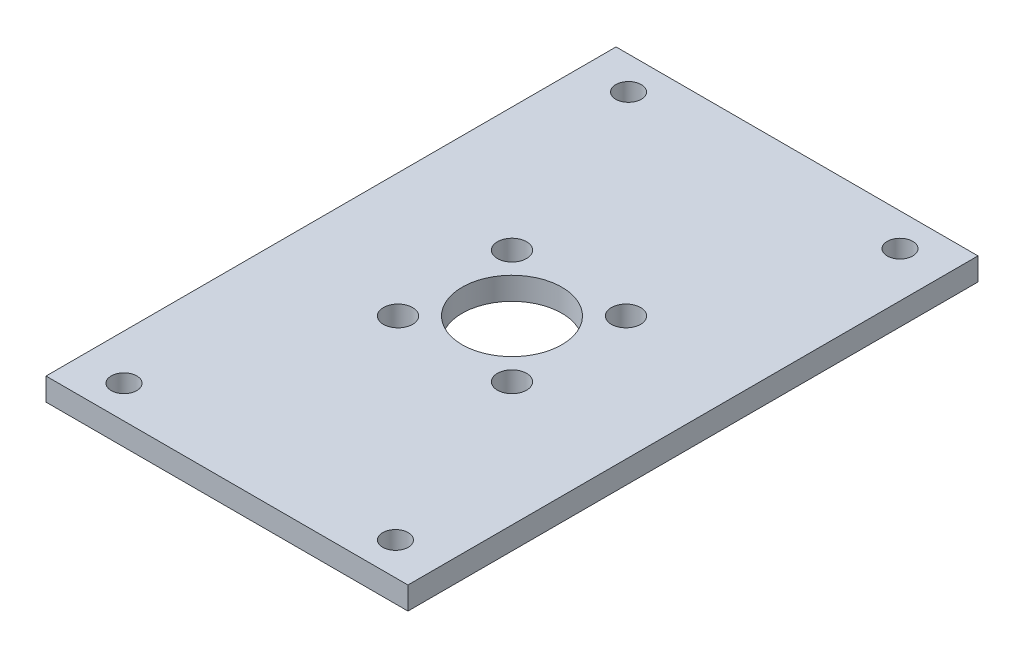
from build123d import *

# Parameters (mm, degrees)
SKETCH1_W           = 50.8
SKETCH1_H           = 80.01
BOSS_EXTRUDE1_DEPTH = 3.175
SKETCH3_R           = 1.7907
CUT_EXTRUDE7_DEPTH  = 3.175
SKETCH5_R           = 7
CUT_EXTRUDE8_DEPTH  = 3.175
CIRPATTERN2_COUNT   = 4
SKETCH6_R           = 2.05
CUT_EXTRUDE9_DEPTH  = 48.493585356
CIRPATTERN3_COUNT   = 4


with BuildPart() as part:
    # Sketch1 → Boss-Extrude1 (new body)
    with BuildSketch(Plane(origin=(0, 0, 0), x_dir=(1, 0, 0), z_dir=(0, 1, 0))):
        Rectangle(SKETCH1_W, SKETCH1_H)
    extrude(amount=BOSS_EXTRUDE1_DEPTH)

    # Sketch3 → Cut-Extrude7 (cut)
    with BuildSketch(Plane(origin=(0, 0, 0), x_dir=(1, 0, 0), z_dir=(0, 1, 0))):
        with Locations(Location((-19.05, 35.4076, 0), (0, 0, 270))):
            Circle(SKETCH3_R)
        with Locations(Location((19.05, 35.4076, 0), (0, 0, 270))):
            Circle(SKETCH3_R)
    cut_extrude7 = extrude(amount=CUT_EXTRUDE7_DEPTH, mode=Mode.SUBTRACT)

    # Sketch5 → Cut-Extrude8 (cut)
    with BuildSketch(Plane(origin=(0, 0, 0), x_dir=(1, 0, 0), z_dir=(0, 1, 0))):
        with Locations(Location((0, 0, 0), (0, 0, 270))):
            Circle(SKETCH5_R)
    extrude(amount=CUT_EXTRUDE8_DEPTH, mode=Mode.SUBTRACT)

    # CirPattern2: Cut-Extrude7 ×4 about axis
    cirpattern2_axis = Axis((0, 3.175, 0), (0, 1, 0))
    for i in range(1, CIRPATTERN2_COUNT):
        add(cut_extrude7.rotate(cirpattern2_axis, i * 360 / CIRPATTERN2_COUNT), mode=Mode.SUBTRACT)

    # Sketch6 → Cut-Extrude9 (cut, through all)
    with BuildSketch(Plane(origin=(0, 3.175, 0), x_dir=(1, 0, 0), z_dir=(0, 1, 0))):
        with Locations(Location((8, 8, 0), (0, 0, 270))):
            Circle(SKETCH6_R)
    cut_extrude9 = extrude(amount=-CUT_EXTRUDE9_DEPTH, mode=Mode.SUBTRACT)

    # CirPattern3: Cut-Extrude9 ×4 about axis
    cirpattern3_axis = Axis((0, 0, 0), (0, 1, 0))
    for i in range(1, CIRPATTERN3_COUNT):
        add(cut_extrude9.rotate(cirpattern3_axis, i * 360 / CIRPATTERN3_COUNT), mode=Mode.SUBTRACT)


solid = part.part
